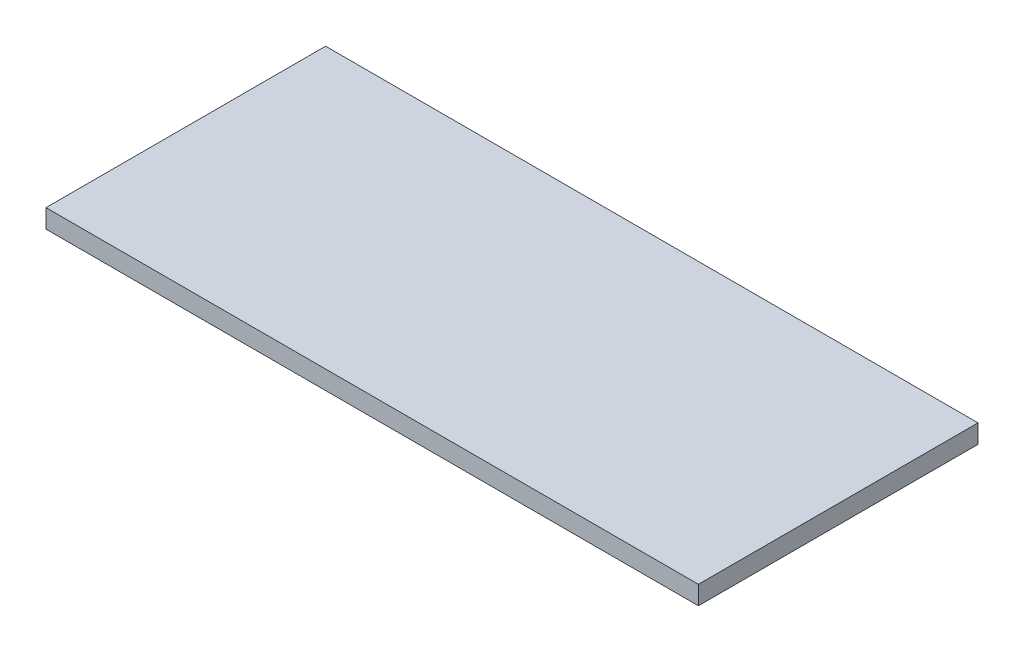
from build123d import *

# Parameters (mm, degrees)
ESQUISSE1_W      = 700
ESQUISSE1_H      = 20
EXTRUSION1_DEPTH = 150


with BuildPart() as part:
    # Esquisse1 → Extrusion1 (new, symmetric)
    with BuildSketch(Plane.XY):
        with Locations((150, -10)):
            Rectangle(ESQUISSE1_W, ESQUISSE1_H)
    extrude(amount=EXTRUSION1_DEPTH, both=True)


solid = part.part
